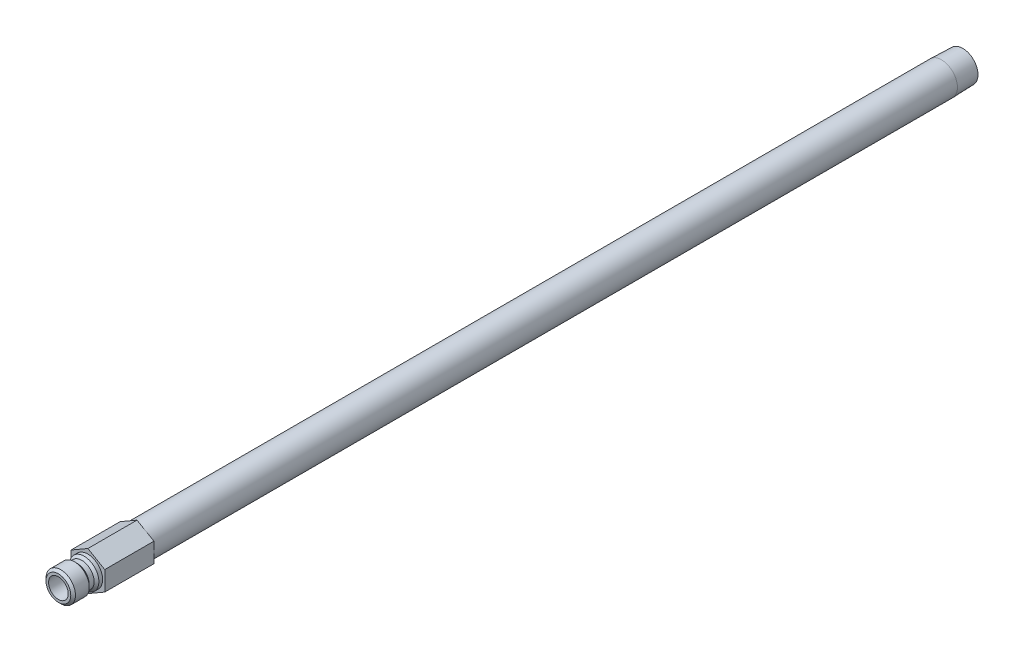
from build123d import *

# Parameters (mm, degrees)
SKETCH2_R           = 2.38125
BOSS_EXTRUDE1_DEPTH = 15.875


with BuildPart() as part:
    # Sketch1 → Revolve1 (revolve)
    with BuildSketch(Plane(origin=(0, 0, 0), x_dir=(0, 0, -1), z_dir=(1, 0, 0))):
        Polygon((-9.525, 3.175), (-9.525, 4.0005), (-8.763, 4.7625), (-4.318, 4.7625), (-3.556, 4.0005), (-1.9685, 4.0005), (-1.2065, 4.7625), (0, 4.7625), (0, 5.1435), (275.717, 5.1435), (282.575, 4.929188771), (282.575, 2.38125), (0.127, 2.38125), (0.127, 3.175), align=None)
    revolve(axis=Axis((0, 0, 0), (0, 0, 1)))

    # Sketch2 → Boss-Extrude1 (add)
    with BuildSketch(Plane.XY):
        Polygon((-5.461, 3.15290982), (-5.461, -3.15290982), (0, -6.30581964), (5.461, -3.15290982), (5.461, 3.15290982), (0, 6.30581964), align=None)
        with Locations(Location((0, 0, 0), (0, 0, 90))):
            Circle(SKETCH2_R, mode=Mode.SUBTRACT)
    extrude(amount=-BOSS_EXTRUDE1_DEPTH)


solid = part.part
